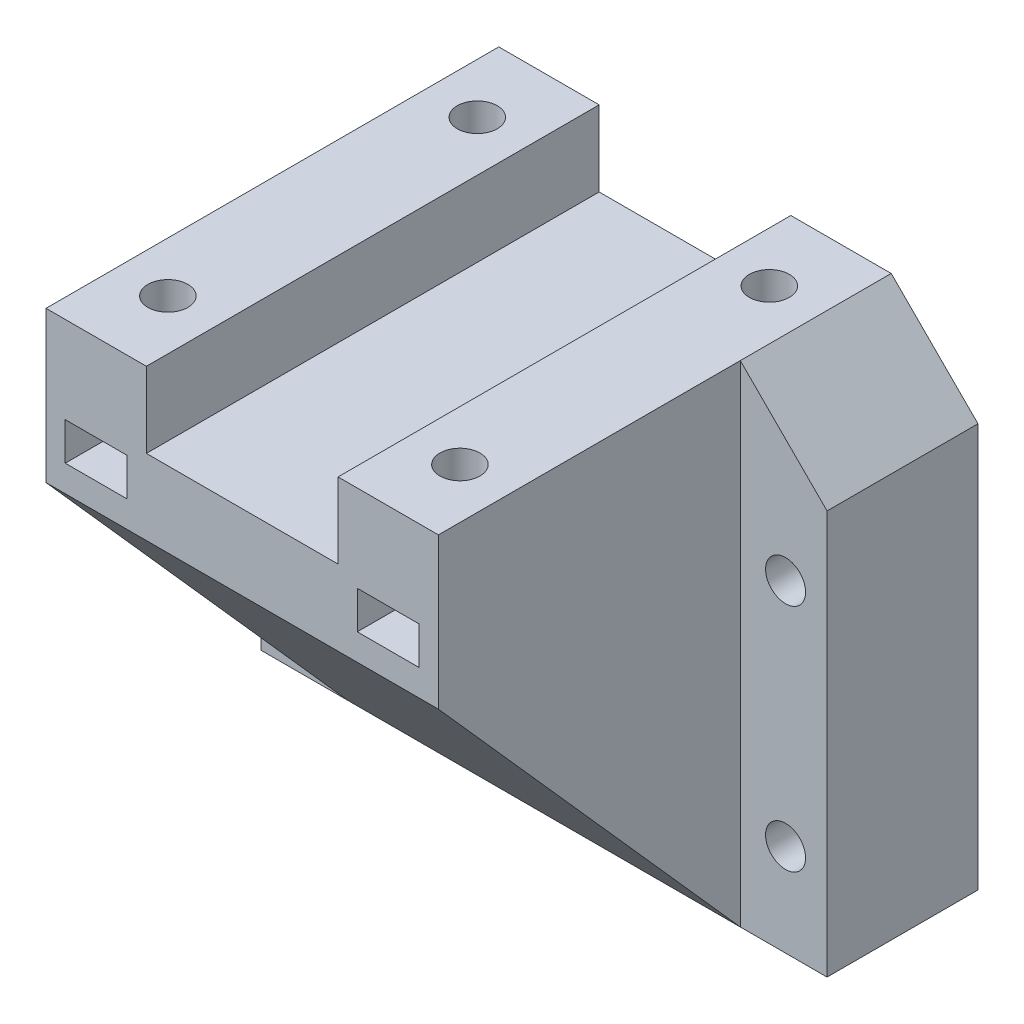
from build123d import *

# Parameters (mm, degrees)
SKETCH_1_W          = 75
SKETCH_1_H          = 55
SKETCH_1_R          = 2.65
EXTRUDE_1_DEPTH     = 20
SKETCH_2_W          = 52
SKETCH_2_H          = 55
EXTRUDE_2_DEPTH     = 40
CUT_EXTRUDE_1_DEPTH = 92.588754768
EXTRUDE_3_DEPTH     = 10
SKETCH_5_R          = 2.65
CUT_EXTRUDE_2_DEPTH = 22
SKETCH_6_W          = 8.2
SKETCH_6_H          = 5
CUT_EXTRUDE_3_DEPTH = 13
SKETCH_8_W          = 8.2
SKETCH_8_H          = 5
CUT_EXTRUDE_4_DEPTH = 13
CUT_EXTRUDE_5_DEPTH = 4.2
CHAMFER_1_SIZE      = 11.5


with BuildPart() as part:
    # Sketch 1 → Extrude 1 (new body)
    with BuildSketch(Plane.XY):
        Rectangle(SKETCH_1_W, SKETCH_1_H)
        with Locations((-32, 15.25)):
            Circle(SKETCH_1_R, mode=Mode.SUBTRACT)
        with Locations((32, 15.25)):
            Circle(SKETCH_1_R, mode=Mode.SUBTRACT)
        with Locations((32, -15.25)):
            Circle(SKETCH_1_R, mode=Mode.SUBTRACT)
        with Locations((-32, -15.25)):
            Circle(SKETCH_1_R, mode=Mode.SUBTRACT)
    extrude(amount=EXTRUDE_1_DEPTH)

    # Sketch 2 → Extrude 2 (add)
    with BuildSketch(Plane.XY.offset(20)):
        Rectangle(SKETCH_2_W, SKETCH_2_H)
    extrude(amount=EXTRUDE_2_DEPTH)

    # Sketch 3 → Cut-Extrude 1 (cut, through all)
    with BuildSketch(Plane.ZY.offset(26)):
        Polygon((60, 17.5), (20, -27.5), (60, -27.5), align=None)
    extrude(amount=-CUT_EXTRUDE_1_DEPTH, mode=Mode.SUBTRACT)

    # Sketch 4 → Extrude 3 (add)
    with BuildSketch(Plane(origin=(0, 27.5, 0), x_dir=(1, 0, 0), z_dir=(0, 1, 0))):
        Polygon((-12.7, -60), (-12.7, 0), (-37.5, 0), (-37.5, -20), (-26, -20), (-26, -60), align=None)
        Polygon((12.7, -60), (12.7, 0), (37.5, 0), (37.5, -20), (26, -20), (26, -60), align=None)
    extrude(amount=EXTRUDE_3_DEPTH)

    # Sketch 5 → Cut-Extrude 2 (cut)
    with BuildSketch(Plane(origin=(0, 37.5, 0), x_dir=(1, 0, 0), z_dir=(0, 1, 0))):
        with Locations(Location((19.35, -50.5, 0), (0, 0, 180))):
            Circle(SKETCH_5_R)
        with Locations(Location((19.35, -9.5, 0), (0, 0, 180))):
            Circle(SKETCH_5_R)
        with Locations((-19.35, -9.5)):
            Circle(SKETCH_5_R)
        with Locations((-19.35, -50.5)):
            Circle(SKETCH_5_R)
    extrude(amount=-CUT_EXTRUDE_2_DEPTH, mode=Mode.SUBTRACT)

    # Sketch 6 → Cut-Extrude 3 (cut)
    with BuildSketch(Plane(origin=(0, 0, 0), x_dir=(-1, 0, 0), z_dir=(0, 0, -1))):
        with Locations((-19.35, 23.5)):
            Rectangle(SKETCH_6_W, SKETCH_6_H)
        with Locations((19.35, 23.5)):
            Rectangle(SKETCH_6_W, SKETCH_6_H)
    extrude(amount=-CUT_EXTRUDE_3_DEPTH, mode=Mode.SUBTRACT)

    # Sketch 8 → Cut-Extrude 4 (cut)
    with BuildSketch(Plane.XY.offset(60)):
        with Locations((19.35, 23.5)):
            Rectangle(SKETCH_8_W, SKETCH_8_H)
        with Locations((-19.35, 23.5)):
            Rectangle(SKETCH_8_W, SKETCH_8_H)
    extrude(amount=-CUT_EXTRUDE_4_DEPTH, mode=Mode.SUBTRACT)

    # Sketch 10 → Cut-Extrude 5 (cut)
    with BuildSketch(Plane(origin=(0, 21, 0), x_dir=(1, 0, 0), z_dir=(0, 1, 0))):
        Polygon((23.45, -7.132863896), (19.35, -4.765727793), (15.25, -7.132863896), (15.25, -11.867136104), (19.35, -14.234272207), (23.45, -11.867136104), align=None)
        Polygon((23.45, -48.132863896), (19.35, -45.765727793), (15.25, -48.132863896), (15.25, -52.867136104), (19.35, -55.234272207), (23.45, -52.867136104), align=None)
        Polygon((-23.45, -52.867136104), (-23.45, -48.132863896), (-19.35, -45.765727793), (-15.25, -48.132863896), (-15.25, -52.867136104), (-19.35, -55.234272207), align=None)
        Polygon((-23.45, -11.867136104), (-23.45, -7.132863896), (-19.35, -4.765727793), (-15.25, -7.132863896), (-15.25, -11.867136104), (-19.35, -14.234272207), align=None)
    extrude(amount=CUT_EXTRUDE_5_DEPTH, mode=Mode.SUBTRACT)

    # Chamfer 1
    chamfer_1_edges = [part.edges().sort_by_distance(p)[0] for p in [
        (37.5, 37.5, 10),
        (-37.5, 37.5, 10),
    ]]
    chamfer(chamfer_1_edges, length=CHAMFER_1_SIZE)


solid = part.part
